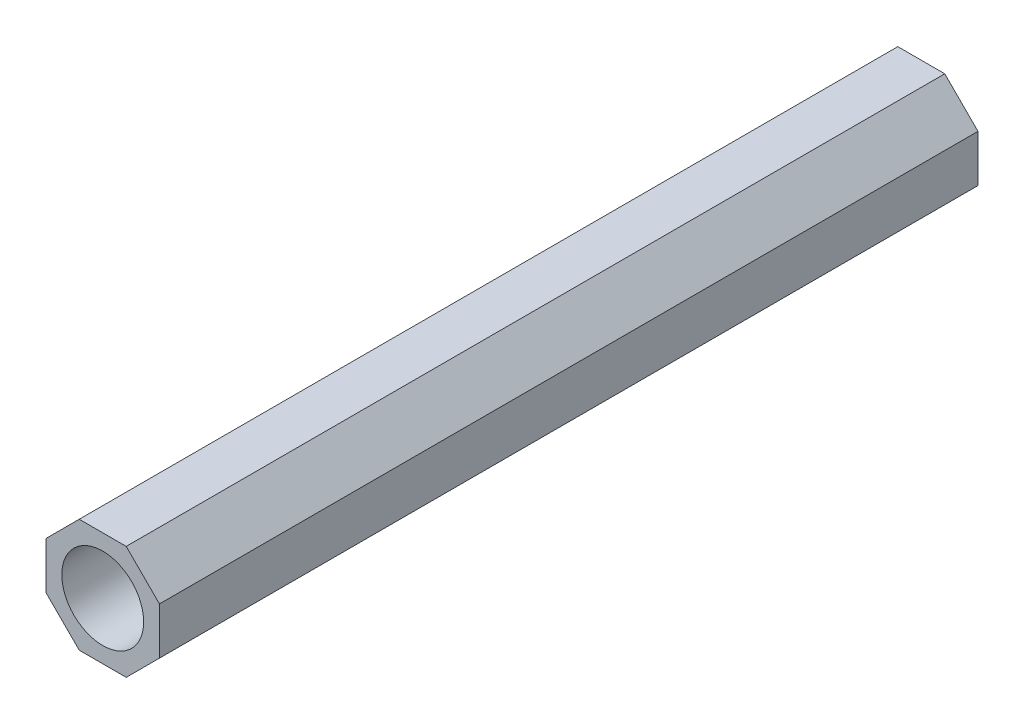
from build123d import *

# Parameters (mm, degrees)
EXTRUDE1_DEPTH     = 127
SKETCH2_R          = 6.35
CUT_EXTRUDE1_DEPTH = 339.454383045


with BuildPart() as part:
    # Sketch1 → Extrude1 (new body)
    with BuildSketch(Plane.XY):
        Polygon((-301.154940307, 8.799952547), (-308.445059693, 8.799952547), (-313.599952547, 3.645059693), (-313.599952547, -3.645059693), (-308.445059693, -8.799952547), (-301.154940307, -8.799952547), (-296.000047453, -3.645059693), (-296.000047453, 3.645059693), align=None)
    extrude(amount=EXTRUDE1_DEPTH)

    # Sketch2 → Cut-Extrude1 (cut, through all)
    with BuildSketch(Plane.XY.offset(127)):
        with Locations((-304.8, 0)):
            Circle(SKETCH2_R)
    extrude(amount=-CUT_EXTRUDE1_DEPTH, mode=Mode.SUBTRACT)


solid = part.part
